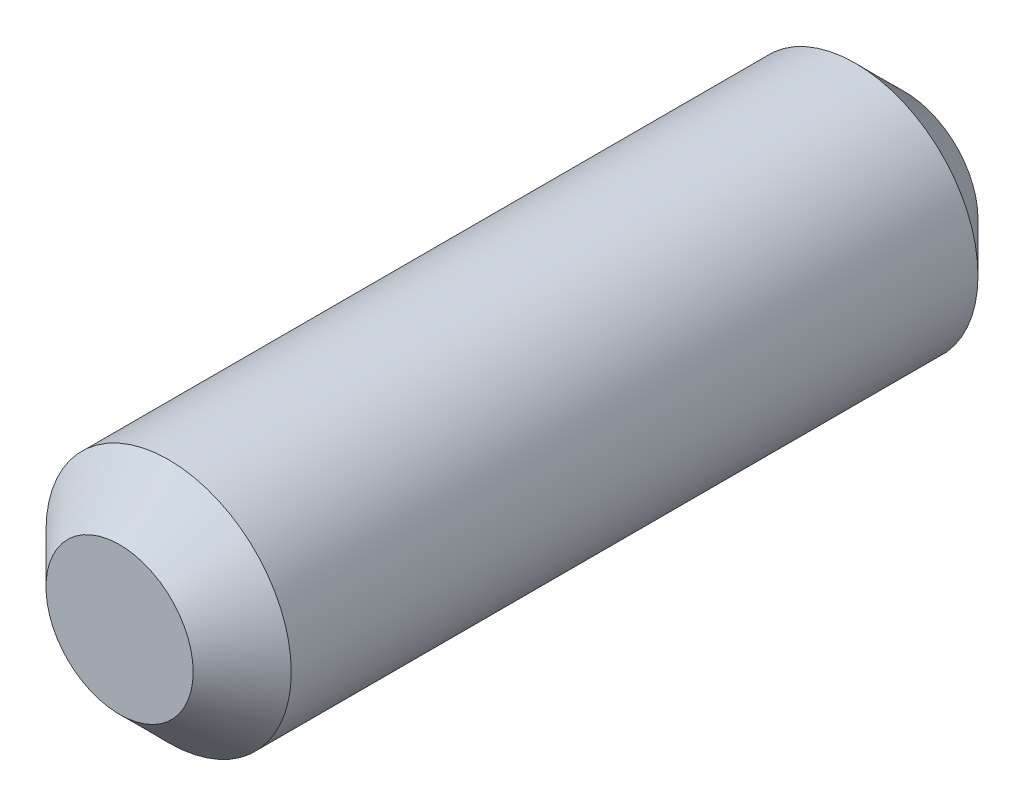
from build123d import *

# Parameters (mm, degrees)
SKETCH1_R           = 1.25
BOSS_EXTRUDE1_DEPTH = 8
CHAMFER1_SIZE       = 0.5


with BuildPart() as part:
    # Sketch1 → Boss-Extrude1 (new body)
    with BuildSketch(Plane.XY):
        with Locations((-3.143783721, 6.828683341)):
            Circle(SKETCH1_R)
    extrude(amount=-BOSS_EXTRUDE1_DEPTH)

    # Chamfer1
    chamfer1_edges = [part.edges().sort_by_distance(p)[0] for p in [
        (-4.393783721, 6.828683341, 0),
        (-4.393783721, 6.828683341, -8),
    ]]
    chamfer(chamfer1_edges, length=CHAMFER1_SIZE)


solid = part.part
